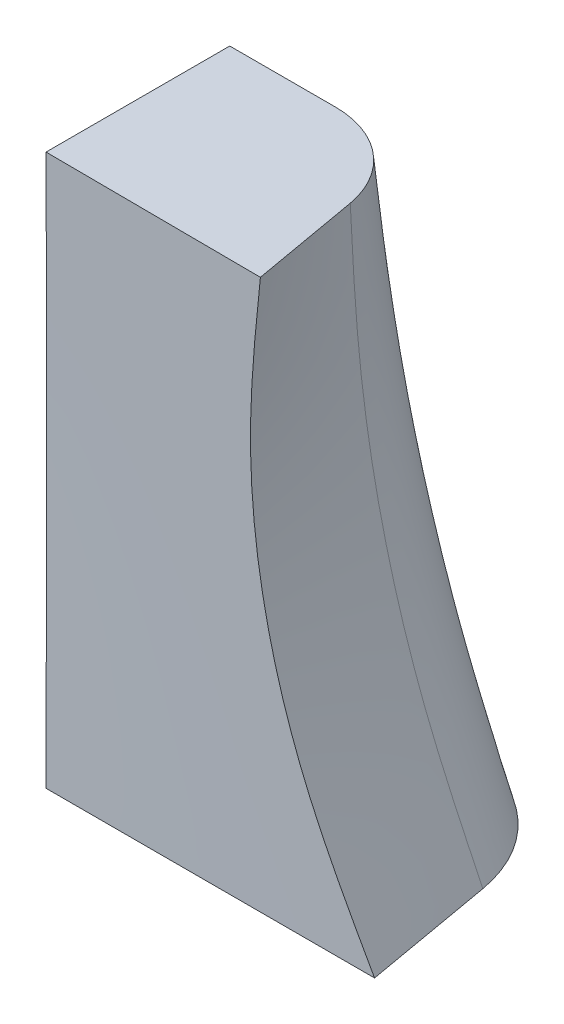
ISO-10303-21;
HEADER;
FILE_DESCRIPTION(('STEP AP214'),'2;1');
FILE_NAME('part.step','',(''),(''),'','','');
FILE_SCHEMA(('AUTOMOTIVE_DESIGN { 1 0 10303 214 1 1 1 1 }'));
ENDSEC;
DATA;
#1=APPLICATION_CONTEXT('core data for automotive mechanical design processes');
#2=APPLICATION_PROTOCOL_DEFINITION('international standard','automotive_design',2000,#1);
#3=PRODUCT_CONTEXT('',#1,'mechanical');
#4=PRODUCT('Part','Part','',(#3));
#5=PRODUCT_RELATED_PRODUCT_CATEGORY('part','',(#4));
#6=PRODUCT_DEFINITION_FORMATION('','',#4);
#7=PRODUCT_DEFINITION_CONTEXT('part definition',#1,'design');
#8=PRODUCT_DEFINITION('design','',#6,#7);
#9=PRODUCT_DEFINITION_SHAPE('','',#8);
#10=(LENGTH_UNIT() NAMED_UNIT(*) SI_UNIT(.MILLI.,.METRE.));
#11=(NAMED_UNIT(*) PLANE_ANGLE_UNIT() SI_UNIT($,.RADIAN.));
#12=(NAMED_UNIT(*) SI_UNIT($,.STERADIAN.) SOLID_ANGLE_UNIT());
#13=UNCERTAINTY_MEASURE_WITH_UNIT(LENGTH_MEASURE(1.E-05),#10,'distance_accuracy_value','');
#14=(GEOMETRIC_REPRESENTATION_CONTEXT(3) GLOBAL_UNCERTAINTY_ASSIGNED_CONTEXT((#13)) GLOBAL_UNIT_ASSIGNED_CONTEXT((#10,
#11,#12)) REPRESENTATION_CONTEXT('',''));
#15=CARTESIAN_POINT('',(0.,0.,0.));
#16=DIRECTION('',(0.,0.,1.));
#17=DIRECTION('',(1.,0.,0.));
#18=AXIS2_PLACEMENT_3D('',#15,#16,#17);
#19=CARTESIAN_POINT('',(0.,0.,0.));
#20=DIRECTION('',(1.,0.,0.));
#21=DIRECTION('',(0.,0.,-1.));
#22=AXIS2_PLACEMENT_3D('',#19,#20,#21);
#23=PLANE('',#22);
#24=DIRECTION('',(0.,0.,1.));
#25=VECTOR('',#24,1.);
#26=CARTESIAN_POINT('',(0.,-76.2,-14.877560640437));
#27=LINE('',#26,#25);
#28=CARTESIAN_POINT('',(0.,-76.2,-33.927560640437));
#29=VERTEX_POINT('',#28);
#30=CARTESIAN_POINT('',(0.,-76.2,0.));
#31=VERTEX_POINT('',#30);
#32=EDGE_CURVE('E112',#29,#31,#27,.T.);
#33=ORIENTED_EDGE('',*,*,#32,.T.);
#34=CARTESIAN_POINT('',(0.,0.,0.));
#35=CARTESIAN_POINT('',(-1.17821968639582E-05,-1.87268849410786,-0.00648347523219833));
#36=CARTESIAN_POINT('',(-0.000104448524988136,-3.74537705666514,-0.0129742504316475));
#37=CARTESIAN_POINT('',(-0.000403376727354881,-7.90213113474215,-0.0268625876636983));
#38=CARTESIAN_POINT('',(-0.000630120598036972,-10.18619702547,-0.0341461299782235));
#39=CARTESIAN_POINT('',(-0.0011067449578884,-15.1641656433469,-0.0483084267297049));
#40=CARTESIAN_POINT('',(-0.00135347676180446,-17.8580693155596,-0.054880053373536));
#41=CARTESIAN_POINT('',(-0.00172382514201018,-23.6480838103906,-0.0652793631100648));
#42=CARTESIAN_POINT('',(-0.00182356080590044,-26.7441956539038,-0.0685508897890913));
#43=CARTESIAN_POINT('',(-0.00186543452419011,-33.3066324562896,-0.0716167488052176));
#44=CARTESIAN_POINT('',(-0.00178730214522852,-36.7729575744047,-0.0709485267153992));
#45=CARTESIAN_POINT('',(-0.00148589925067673,-44.0168844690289,-0.0657968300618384));
#46=CARTESIAN_POINT('',(-0.00125022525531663,-47.7944859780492,-0.0609761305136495));
#47=CARTESIAN_POINT('',(-0.000757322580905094,-55.5722846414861,-0.048073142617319));
#48=CARTESIAN_POINT('',(-0.000499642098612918,-59.5724814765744,-0.0398153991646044));
#49=CARTESIAN_POINT('',(-0.00010535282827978,-67.7817859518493,-0.0211164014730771));
#50=CARTESIAN_POINT('',(2.42300176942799E-05,-71.9908933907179,-0.0105836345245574));
#51=CARTESIAN_POINT('',(0.,-76.2,0.));
#52=B_SPLINE_CURVE_WITH_KNOTS('',3,(#34,#35,#36,#37,#38,#39,#40,#41,#42,#43,#44,#45,#46,#47,#48,
#49,#50,#51),.UNSPECIFIED.,.F.,.F.,(4,2,2,2,2,2,2,2,4),(0.,5.61809930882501,12.4703317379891,
20.5520651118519,29.8404027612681,40.2393760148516,51.5721879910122,63.5728035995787,
76.2001644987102),.UNSPECIFIED.);
#53=CARTESIAN_POINT('',(0.,0.,0.));
#54=VERTEX_POINT('',#53);
#55=EDGE_CURVE('E101',#31,#54,#52,.F.);
#56=ORIENTED_EDGE('',*,*,#55,.T.);
#57=DIRECTION('',(0.,0.,-1.));
#58=VECTOR('',#57,1.);
#59=CARTESIAN_POINT('',(0.,0.,-12.7));
#60=LINE('',#59,#58);
#61=CARTESIAN_POINT('',(0.,0.,-25.4));
#62=VERTEX_POINT('',#61);
#63=EDGE_CURVE('E81',#54,#62,#60,.T.);
#64=ORIENTED_EDGE('',*,*,#63,.T.);
#65=CARTESIAN_POINT('',(0.,0.,-25.4));
#66=CARTESIAN_POINT('',(0.,-1.29533201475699,-25.5433238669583));
#67=CARTESIAN_POINT('',(0.,-2.59066405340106,-25.6866476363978));
#68=CARTESIAN_POINT('',(0.,-5.18134355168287,-25.9731586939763));
#69=CARTESIAN_POINT('',(0.,-6.47669101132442,-26.1163459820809));
#70=CARTESIAN_POINT('',(0.,-9.06741616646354,-26.4024477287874));
#71=CARTESIAN_POINT('',(0.,-10.3627938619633,-26.5453621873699));
#72=CARTESIAN_POINT('',(0.,-12.9535981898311,-26.8307798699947));
#73=CARTESIAN_POINT('',(0.,-14.2490248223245,-26.9732830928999));
#74=CARTESIAN_POINT('',(0.,-16.839937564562,-27.257746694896));
#75=CARTESIAN_POINT('',(0.,-18.1354236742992,-27.3997070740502));
#76=CARTESIAN_POINT('',(0.,-20.7264728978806,-27.6829224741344));
#77=CARTESIAN_POINT('',(0.,-22.0220360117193,-27.8241774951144));
#78=CARTESIAN_POINT('',(0.,-25.2610097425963,-28.1767176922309));
#79=CARTESIAN_POINT('',(0.,-27.2044528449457,-28.3877041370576));
#80=CARTESIAN_POINT('',(0.,-31.0913585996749,-28.8094997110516));
#81=CARTESIAN_POINT('',(0.,-33.0348212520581,-29.0203088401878));
#82=CARTESIAN_POINT('',(0.,-36.9216589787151,-29.4426568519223));
#83=CARTESIAN_POINT('',(0.,-38.8650340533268,-29.6541957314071));
#84=CARTESIAN_POINT('',(0.,-42.7515978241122,-30.0789806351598));
#85=CARTESIAN_POINT('',(0.,-44.6947865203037,-30.2922266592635));
#86=CARTESIAN_POINT('',(0.,-47.8702938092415,-30.6430134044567));
#87=CARTESIAN_POINT('',(0.,-49.1027043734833,-30.7797210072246));
#88=CARTESIAN_POINT('',(0.,-51.5673654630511,-31.054572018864));
#89=CARTESIAN_POINT('',(0.,-52.799615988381,-31.1927154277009));
#90=CARTESIAN_POINT('',(0.,-55.2639194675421,-31.4707578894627));
#91=CARTESIAN_POINT('',(0.,-56.4959724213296,-31.6106569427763));
#92=CARTESIAN_POINT('',(0.,-58.9598255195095,-31.8926623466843));
#93=CARTESIAN_POINT('',(0.,-60.1916256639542,-32.0347686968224));
#94=CARTESIAN_POINT('',(0.,-62.655018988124,-32.3209626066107));
#95=CARTESIAN_POINT('',(0.,-63.8866121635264,-32.4650502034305));
#96=CARTESIAN_POINT('',(0.,-66.3496199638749,-32.754747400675));
#97=CARTESIAN_POINT('',(0.,-67.5810345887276,-32.9003570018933));
#98=CARTESIAN_POINT('',(0.,-70.0437403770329,-33.1926315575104));
#99=CARTESIAN_POINT('',(0.,-71.2750315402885,-33.3392965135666));
#100=CARTESIAN_POINT('',(0.,-73.7375487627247,-33.6331593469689));
#101=CARTESIAN_POINT('',(0.,-74.9687748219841,-33.7803572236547));
#102=CARTESIAN_POINT('',(0.,-76.2,-33.927560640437));
#103=B_SPLINE_CURVE_WITH_KNOTS('',3,(#65,#66,#67,#68,#69,#70,#71,#72,#73,#74,#75,#76,#77,#78,
#79,#80,#81,#82,#83,#84,#85,#86,#87,#88,#89,#90,#91,#92,#93,#94,#95,#96,#97,#98,#99,#100,#101,
#102),.UNSPECIFIED.,.F.,.F.,(4,2,2,2,2,2,2,2,2,2,2,2,2,2,2,2,2,2,4),(0.,3.90971111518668,
7.81942321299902,11.7291355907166,15.6388587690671,19.5485814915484,23.4583039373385,
29.3228905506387,35.1874781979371,41.052040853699,46.9166029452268,50.6365112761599,
54.3564195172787,58.0763285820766,61.7962368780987,65.5162150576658,69.2361951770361,
72.9561811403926,76.6761624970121),.UNSPECIFIED.);
#104=EDGE_CURVE('E14',#62,#29,#103,.T.);
#105=ORIENTED_EDGE('',*,*,#104,.T.);
#106=EDGE_LOOP('',(#33,#56,#64,#105));
#107=FACE_BOUND('',#106,.T.);
#108=ADVANCED_FACE('F58',(#107),#23,.F.);
#109=CARTESIAN_POINT('',(-23.4582958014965,-76.2,-14.877560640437));
#110=DIRECTION('',(0.,-1.,0.));
#111=DIRECTION('',(0.,0.,-1.));
#112=AXIS2_PLACEMENT_3D('',#109,#110,#111);
#113=PLANE('',#112);
#114=ORIENTED_EDGE('',*,*,#32,.F.);
#115=DIRECTION('',(-1.,0.,0.));
#116=VECTOR('',#115,1.);
#117=CARTESIAN_POINT('',(23.4582958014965,-76.2,-33.927560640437));
#118=LINE('',#117,#116);
#119=CARTESIAN_POINT('',(23.4582958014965,-76.2,-33.927560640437));
#120=VERTEX_POINT('',#119);
#121=EDGE_CURVE('E111',#120,#29,#118,.T.);
#122=ORIENTED_EDGE('',*,*,#121,.F.);
#123=CARTESIAN_POINT('',(23.4582958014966,-76.2,-14.877560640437));
#124=DIRECTION('',(0.,1.,0.));
#125=DIRECTION('',(0.,0.,1.));
#126=AXIS2_PLACEMENT_3D('',#123,#124,#125);
#127=CIRCLE('',#126,19.05);
#128=CARTESIAN_POINT('',(42.2188834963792,-76.2,-18.1855584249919));
#129=VERTEX_POINT('',#128);
#130=EDGE_CURVE('E168',#129,#120,#127,.T.);
#131=ORIENTED_EDGE('',*,*,#130,.F.);
#132=DIRECTION('',(-0.173648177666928,0.,-0.984807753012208));
#133=VECTOR('',#132,1.);
#134=CARTESIAN_POINT('',(45.4254881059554,-76.2,0.));
#135=LINE('',#134,#133);
#136=CARTESIAN_POINT('',(45.4254881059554,-76.2,0.));
#137=VERTEX_POINT('',#136);
#138=EDGE_CURVE('E120',#137,#129,#135,.T.);
#139=ORIENTED_EDGE('',*,*,#138,.F.);
#140=DIRECTION('',(1.,0.,0.));
#141=VECTOR('',#140,1.);
#142=CARTESIAN_POINT('',(0.,-76.2,0.));
#143=LINE('',#142,#141);
#144=EDGE_CURVE('E106',#31,#137,#143,.T.);
#145=ORIENTED_EDGE('',*,*,#144,.F.);
#146=EDGE_LOOP('',(#114,#122,#131,#139,#145));
#147=FACE_BOUND('',#146,.T.);
#148=ADVANCED_FACE('F60',(#147),#113,.T.);
#149=CARTESIAN_POINT('',(-15.0010822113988,0.,-12.7));
#150=DIRECTION('',(0.,1.,0.));
#151=DIRECTION('',(0.,0.,1.));
#152=AXIS2_PLACEMENT_3D('',#149,#150,#151);
#153=PLANE('',#152);
#154=ORIENTED_EDGE('',*,*,#63,.F.);
#155=DIRECTION('',(0.999982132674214,0.,0.00597782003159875));
#156=VECTOR('',#155,1.);
#157=CARTESIAN_POINT('',(0.,0.,0.));
#158=LINE('',#157,#156);
#159=CARTESIAN_POINT('',(29.8187001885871,0.,0.178254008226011));
#160=VERTEX_POINT('',#159);
#161=EDGE_CURVE('E67',#54,#160,#158,.T.);
#162=ORIENTED_EDGE('',*,*,#161,.T.);
#163=DIRECTION('',(0.173648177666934,0.,0.984807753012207));
#164=VECTOR('',#163,1.);
#165=CARTESIAN_POINT('',(27.159057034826,0.,-14.9053318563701));
#166=LINE('',#165,#164);
#167=CARTESIAN_POINT('',(27.159057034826,0.,-14.9053318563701));
#168=VERTEX_POINT('',#167);
#169=EDGE_CURVE('E140',#168,#160,#166,.T.);
#170=ORIENTED_EDGE('',*,*,#169,.F.);
#171=CARTESIAN_POINT('',(14.6519985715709,0.,-12.7));
#172=DIRECTION('',(0.,1.,0.));
#173=DIRECTION('',(0.,0.,1.));
#174=AXIS2_PLACEMENT_3D('',#171,#172,#173);
#175=CIRCLE('',#174,12.7);
#176=CARTESIAN_POINT('',(14.6519985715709,0.,-25.4));
#177=VERTEX_POINT('',#176);
#178=EDGE_CURVE('E136',#168,#177,#175,.T.);
#179=ORIENTED_EDGE('',*,*,#178,.T.);
#180=DIRECTION('',(-1.,0.,0.));
#181=VECTOR('',#180,1.);
#182=CARTESIAN_POINT('',(14.6519985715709,0.,-25.4));
#183=LINE('',#182,#181);
#184=EDGE_CURVE('E134',#177,#62,#183,.T.);
#185=ORIENTED_EDGE('',*,*,#184,.T.);
#186=EDGE_LOOP('',(#154,#162,#170,#179,#185));
#187=FACE_BOUND('',#186,.T.);
#188=ADVANCED_FACE('F182',(#187),#153,.T.);
#189=CARTESIAN_POINT('',(29.8187001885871,0.,0.178254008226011));
#190=CARTESIAN_POINT('',(29.0965883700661,-6.63484166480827,0.140421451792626));
#191=CARTESIAN_POINT('',(26.930252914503,-26.5393666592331,0.0269237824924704));
#192=CARTESIAN_POINT('',(32.3360496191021,-52.9331198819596,0.000928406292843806));
#193=CARTESIAN_POINT('',(42.153128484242,-70.3832799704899,0.000232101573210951));
#194=CARTESIAN_POINT('',(45.4254881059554,-76.2,0.));
#195=CARTESIAN_POINT('',(19.8791334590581,0.,0.118836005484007));
#196=CARTESIAN_POINT('',(19.3973049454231,-6.63329244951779,0.0859549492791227));
#197=CARTESIAN_POINT('',(17.951819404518,-26.5331697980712,-0.0126882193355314));
#198=CARTESIAN_POINT('',(21.5565057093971,-52.9266079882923,-0.018877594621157));
#199=CARTESIAN_POINT('',(28.101870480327,-70.3816519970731,-0.00471939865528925));
#200=CARTESIAN_POINT('',(30.2836587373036,-76.2,0.));
#201=CARTESIAN_POINT('',(9.93956672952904,0.,0.0594180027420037));
#202=CARTESIAN_POINT('',(9.69802152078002,-6.63174323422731,0.0314884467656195));
#203=CARTESIAN_POINT('',(8.97338589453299,-26.5269729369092,-0.0523002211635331));
#204=CARTESIAN_POINT('',(10.776961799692,-52.9200960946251,-0.0386835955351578));
#205=CARTESIAN_POINT('',(14.0506124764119,-70.3800240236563,-0.00967089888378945));
#206=CARTESIAN_POINT('',(15.1418293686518,-76.2,0.));
#207=CARTESIAN_POINT('',(0.,0.,0.));
#208=CARTESIAN_POINT('',(-0.00126190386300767,-6.63019401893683,-0.0229780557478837));
#209=CARTESIAN_POINT('',(-0.00504761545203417,-26.5207760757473,-0.0919122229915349));
#210=CARTESIAN_POINT('',(-0.00258211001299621,-52.9135842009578,-0.0584895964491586));
#211=CARTESIAN_POINT('',(-0.000645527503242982,-70.3783960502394,-0.0146223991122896));
#212=CARTESIAN_POINT('',(0.,-76.2,0.));
#213=B_SPLINE_SURFACE_WITH_KNOTS('',3,3,((#189,#190,#191,#192,#193,#194),(#195,#196,#197,#198,
#199,#200),(#201,#202,#203,#204,#205,#206),(#207,#208,#209,#210,#211,#212)),.UNSPECIFIED.,.F.,
.F.,.F.,(4,4),(4,1,1,4),(0.,1.),(0.,0.25,0.75,1.),.UNSPECIFIED.);
#214=CARTESIAN_POINT('',(29.8187001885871,0.,0.178254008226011));
#215=CARTESIAN_POINT('',(29.0965883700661,-6.63484166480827,0.140421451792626));
#216=CARTESIAN_POINT('',(26.930252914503,-26.5393666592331,0.0269237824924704));
#217=CARTESIAN_POINT('',(32.3360496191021,-52.9331198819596,0.000928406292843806));
#218=CARTESIAN_POINT('',(42.153128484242,-70.3832799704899,0.000232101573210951));
#219=CARTESIAN_POINT('',(45.4254881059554,-76.2,0.));
#220=B_SPLINE_CURVE_WITH_KNOTS('',3,(#214,#215,#216,#217,#218,#219),.UNSPECIFIED.,.F.,.F.,(4,1,
1,4),(0.,0.25,0.75,1.),.UNSPECIFIED.);
#221=EDGE_CURVE('E137',#137,#160,#220,.F.);
#222=ORIENTED_EDGE('',*,*,#55,.F.);
#223=ORIENTED_EDGE('',*,*,#144,.T.);
#224=ORIENTED_EDGE('',*,*,#221,.T.);
#225=ORIENTED_EDGE('',*,*,#161,.F.);
#226=EDGE_LOOP('',(#222,#223,#224,#225));
#227=FACE_BOUND('',#226,.T.);
#228=ADVANCED_FACE('F104',(#227),#213,.T.);
#229=CARTESIAN_POINT('',(27.159057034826,0.,-14.9053318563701));
#230=CARTESIAN_POINT('',(27.1999313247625,-6.6329826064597,-15.2016621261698));
#231=CARTESIAN_POINT('',(27.3225541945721,-26.5319304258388,-16.0906529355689));
#232=CARTESIAN_POINT('',(32.4656029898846,-52.9253056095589,-17.1506391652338));
#233=CARTESIAN_POINT('',(39.7805633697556,-70.3813264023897,-17.9268286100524));
#234=CARTESIAN_POINT('',(42.2188834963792,-76.2,-18.1855584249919));
#235=CARTESIAN_POINT('',(27.186761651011,0.,-14.7482111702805));
#236=CARTESIAN_POINT('',(27.2278938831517,-6.6329826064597,-15.0430785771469));
#237=CARTESIAN_POINT('',(27.3517168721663,-26.5319304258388,-15.9252631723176));
#238=CARTESIAN_POINT('',(32.4966282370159,-52.9253056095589,-16.9746862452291));
#239=CARTESIAN_POINT('',(39.8132732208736,-70.3813264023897,-17.7413218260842));
#240=CARTESIAN_POINT('',(42.252285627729,-76.2,-17.9961255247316));
#241=CARTESIAN_POINT('',(27.2802647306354,0.,-14.2179288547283));
#242=CARTESIAN_POINT('',(27.2863675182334,-6.63306732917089,-14.5024786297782));
#243=CARTESIAN_POINT('',(27.3046758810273,-26.5322693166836,-15.3561279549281));
#244=CARTESIAN_POINT('',(32.4596988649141,-52.9256617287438,-16.3689922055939));
#245=CARTESIAN_POINT('',(39.8886880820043,-70.381415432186,-17.1098401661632));
#246=CARTESIAN_POINT('',(42.3650178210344,-76.2,-17.3567894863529));
#247=CARTESIAN_POINT('',(28.1668124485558,0.,-9.19006689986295));
#248=CARTESIAN_POINT('',(27.9185865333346,-6.63368701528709,-9.38845077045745));
#249=CARTESIAN_POINT('',(27.1739087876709,-26.5347480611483,-9.98360238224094));
#250=CARTESIAN_POINT('',(32.4165144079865,-52.9282664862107,-10.651803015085));
#251=CARTESIAN_POINT('',(40.6795431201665,-70.3820666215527,-11.134153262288));
#252=CARTESIAN_POINT('',(43.4338860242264,-76.2,-11.2949366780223));
#253=CARTESIAN_POINT('',(29.0256555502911,0.,-4.31932563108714));
#254=CARTESIAN_POINT('',(28.5310487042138,-6.63428733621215,-4.43423628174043));
#255=CARTESIAN_POINT('',(27.047228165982,-26.5371493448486,-4.7789682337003));
#256=CARTESIAN_POINT('',(32.374679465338,-52.9307898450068,-5.11327598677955));
#257=CARTESIAN_POINT('',(41.4456839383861,-70.3826974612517,-5.34520657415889));
#258=CARTESIAN_POINT('',(44.4693520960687,-76.2,-5.42251676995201));
#259=CARTESIAN_POINT('',(29.8187001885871,0.,0.178254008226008));
#260=CARTESIAN_POINT('',(29.0965883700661,-6.63484166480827,0.140421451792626));
#261=CARTESIAN_POINT('',(26.930252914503,-26.5393666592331,0.0269237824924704));
#262=CARTESIAN_POINT('',(32.3360496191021,-52.9331198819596,0.000928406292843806));
#263=CARTESIAN_POINT('',(42.153128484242,-70.3832799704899,0.000232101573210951));
#264=CARTESIAN_POINT('',(45.4254881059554,-76.2,0.));
#265=B_SPLINE_SURFACE_WITH_KNOTS('',3,3,((#229,#230,#231,#232,#233,#234),(#235,#236,#237,#238,
#239,#240),(#241,#242,#243,#244,#245,#246),(#247,#248,#249,#250,#251,#252),(#253,#254,#255,#256,
#257,#258),(#259,#260,#261,#262,#263,#264)),.UNSPECIFIED.,.F.,.F.,.F.,(4,1,1,4),(4,1,1,4),(0.,
0.03125,0.10546875,1.),(0.,0.25,0.75,1.),.UNSPECIFIED.);
#266=CARTESIAN_POINT('',(27.159057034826,0.,-14.9053318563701));
#267=CARTESIAN_POINT('',(27.1999313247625,-6.6329826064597,-15.2016621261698));
#268=CARTESIAN_POINT('',(27.3225541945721,-26.5319304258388,-16.0906529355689));
#269=CARTESIAN_POINT('',(32.4656029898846,-52.9253056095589,-17.1506391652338));
#270=CARTESIAN_POINT('',(39.7805633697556,-70.3813264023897,-17.9268286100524));
#271=CARTESIAN_POINT('',(42.2188834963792,-76.2,-18.1855584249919));
#272=B_SPLINE_CURVE_WITH_KNOTS('',3,(#266,#267,#268,#269,#270,#271),.UNSPECIFIED.,.F.,.F.,(4,1,
1,4),(0.,0.25,0.75,1.),.UNSPECIFIED.);
#273=EDGE_CURVE('E147',#129,#168,#272,.F.);
#274=ORIENTED_EDGE('',*,*,#169,.T.);
#275=ORIENTED_EDGE('',*,*,#221,.F.);
#276=ORIENTED_EDGE('',*,*,#138,.T.);
#277=ORIENTED_EDGE('',*,*,#273,.T.);
#278=EDGE_LOOP('',(#274,#275,#276,#277));
#279=FACE_BOUND('',#278,.T.);
#280=ADVANCED_FACE('F191',(#279),#265,.T.);
#281=CARTESIAN_POINT('',(14.6519985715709,0.,-25.4));
#282=CARTESIAN_POINT('',(14.980311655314,-6.63112354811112,-26.1336081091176));
#283=CARTESIAN_POINT('',(15.9652509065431,-26.5244941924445,-28.3344324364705));
#284=CARTESIAN_POINT('',(18.9433625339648,-52.9174913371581,-31.1435300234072));
#285=CARTESIAN_POINT('',(22.3295624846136,-70.3793728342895,-33.2315529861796));
#286=CARTESIAN_POINT('',(23.4582958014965,-76.2,-33.927560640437));
#287=CARTESIAN_POINT('',(14.8229024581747,0.,-25.4));
#288=CARTESIAN_POINT('',(15.1511928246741,-6.63112354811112,-26.1336081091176));
#289=CARTESIAN_POINT('',(16.1360639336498,-26.5244941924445,-28.3344324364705));
#290=CARTESIAN_POINT('',(19.1433701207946,-52.9174913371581,-31.1435300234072));
#291=CARTESIAN_POINT('',(22.5718312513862,-70.3793728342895,-33.2315529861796));
#292=CARTESIAN_POINT('',(23.7146516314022,-76.2,-33.927560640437));
#293=CARTESIAN_POINT('',(15.4075859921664,0.,-25.3882251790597));
#294=CARTESIAN_POINT('',(15.7356194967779,-6.63119657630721,-26.1213426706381));
#295=CARTESIAN_POINT('',(16.7197200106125,-26.5247863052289,-28.3206951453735));
#296=CARTESIAN_POINT('',(19.826922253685,-52.9177983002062,-31.1278302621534));
#297=CARTESIAN_POINT('',(23.4004882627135,-70.3794495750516,-33.2143813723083));
#298=CARTESIAN_POINT('',(24.5916769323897,-76.2,-33.9098984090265));
#299=CARTESIAN_POINT('',(21.0012962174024,0.,-24.8883699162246));
#300=CARTESIAN_POINT('',(21.3205484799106,-6.631752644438,-25.6006601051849));
#301=CARTESIAN_POINT('',(22.2783052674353,-26.527010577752,-27.7375306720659));
#302=CARTESIAN_POINT('',(26.3418494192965,-52.9201356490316,-30.4613565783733));
#303=CARTESIAN_POINT('',(31.322144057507,-70.3800339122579,-32.4854257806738));
#304=CARTESIAN_POINT('',(32.9822422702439,-76.2,-33.1601155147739));
#305=CARTESIAN_POINT('',(25.552655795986,0.,-21.0693257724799));
#306=CARTESIAN_POINT('',(25.8002115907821,-6.6323535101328,-21.6224891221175));
#307=CARTESIAN_POINT('',(26.5428789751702,-26.5294140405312,-23.2819791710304));
#308=CARTESIAN_POINT('',(31.3909779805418,-52.9226612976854,-25.369297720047));
#309=CARTESIAN_POINT('',(37.704705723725,-70.3806653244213,-26.9159864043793));
#310=CARTESIAN_POINT('',(39.8092816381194,-76.2,-27.4315492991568));
#311=CARTESIAN_POINT('',(27.0162547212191,0.,-15.6473955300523));
#312=CARTESIAN_POINT('',(27.0829413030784,-6.6329095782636,-15.9746451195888));
#313=CARTESIAN_POINT('',(27.2830010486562,-26.5316383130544,-16.9563938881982));
#314=CARTESIAN_POINT('',(32.3990900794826,-52.9249986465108,-18.1400573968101));
#315=CARTESIAN_POINT('',(39.6032825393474,-70.3812496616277,-19.009004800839));
#316=CARTESIAN_POINT('',(42.004680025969,-76.2,-19.2986539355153));
#317=CARTESIAN_POINT('',(27.129379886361,0.,-15.0736393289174));
#318=CARTESIAN_POINT('',(27.1692087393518,-6.6329826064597,-15.3758985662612));
#319=CARTESIAN_POINT('',(27.2884406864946,-26.5319304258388,-16.2841202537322));
#320=CARTESIAN_POINT('',(32.4265816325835,-52.9253056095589,-17.3719402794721));
#321=CARTESIAN_POINT('',(39.7374777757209,-70.3813264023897,-18.1711791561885));
#322=CARTESIAN_POINT('',(42.1743677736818,-76.2,-18.4380196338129));
#323=CARTESIAN_POINT('',(27.159057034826,0.,-14.9053318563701));
#324=CARTESIAN_POINT('',(27.1999313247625,-6.6329826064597,-15.2016621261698));
#325=CARTESIAN_POINT('',(27.3225541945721,-26.5319304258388,-16.0906529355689));
#326=CARTESIAN_POINT('',(32.4656029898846,-52.9253056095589,-17.1506391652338));
#327=CARTESIAN_POINT('',(39.7805633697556,-70.3813264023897,-17.9268286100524));
#328=CARTESIAN_POINT('',(42.2188834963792,-76.2,-18.1855584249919));
#329=(BOUNDED_SURFACE() B_SPLINE_SURFACE(3,3,((#281,#282,#283,#284,#285,#286),(#287,#288,#289,
#290,#291,#292),(#293,#294,#295,#296,#297,#298),(#299,#300,#301,#302,#303,#304),(#305,#306,#307,
#308,#309,#310),(#311,#312,#313,#314,#315,#316),(#317,#318,#319,#320,#321,#322),(#323,#324,#325,
#326,#327,#328)),.UNSPECIFIED.,.F.,.F.,.F.) B_SPLINE_SURFACE_WITH_KNOTS((4,1,1,1,1,4),(4,1,1,4),
(0.,0.03125,0.10546875,0.89453125,0.96875,1.),(0.,0.25,0.75,1.),
.UNSPECIFIED.) GEOMETRIC_REPRESENTATION_ITEM() RATIONAL_B_SPLINE_SURFACE(((1.,1.,1.,1.,1.,1.),
(0.995125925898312,0.995125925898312,0.995125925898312,0.995125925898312,0.995125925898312,
0.995125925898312),(0.979189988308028,0.979189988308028,0.979189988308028,0.979189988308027,
0.979189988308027,0.979189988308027),(0.858744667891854,0.858744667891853,0.858744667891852,
0.858744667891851,0.85874466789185,0.85874466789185),(0.858744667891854,0.858744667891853,
0.858744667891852,0.858744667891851,0.85874466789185,0.85874466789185),(0.979189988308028,
0.979189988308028,0.979189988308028,0.979189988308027,0.979189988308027,0.979189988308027),
(0.995125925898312,0.995125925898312,0.995125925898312,0.995125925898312,0.995125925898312,
0.995125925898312),(1.,1.,1.,1.,1.,1.))) REPRESENTATION_ITEM('') SURFACE());
#330=CARTESIAN_POINT('',(14.6519985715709,0.,-25.4));
#331=CARTESIAN_POINT('',(14.980311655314,-6.63112354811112,-26.1336081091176));
#332=CARTESIAN_POINT('',(15.9652509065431,-26.5244941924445,-28.3344324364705));
#333=CARTESIAN_POINT('',(18.9433625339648,-52.9174913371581,-31.1435300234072));
#334=CARTESIAN_POINT('',(22.3295624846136,-70.3793728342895,-33.2315529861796));
#335=CARTESIAN_POINT('',(23.4582958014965,-76.2,-33.927560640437));
#336=B_SPLINE_CURVE_WITH_KNOTS('',3,(#330,#331,#332,#333,#334,#335),.UNSPECIFIED.,.F.,.F.,(4,1,
1,4),(0.,0.25,0.75,1.),.UNSPECIFIED.);
#337=EDGE_CURVE('E121',#120,#177,#336,.F.);
#338=ORIENTED_EDGE('',*,*,#178,.F.);
#339=ORIENTED_EDGE('',*,*,#273,.F.);
#340=ORIENTED_EDGE('',*,*,#130,.T.);
#341=ORIENTED_EDGE('',*,*,#337,.T.);
#342=EDGE_LOOP('',(#338,#339,#340,#341));
#343=FACE_BOUND('',#342,.T.);
#344=ADVANCED_FACE('F216',(#343),#329,.T.);
#345=CARTESIAN_POINT('',(-15.0010822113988,0.,-25.4));
#346=CARTESIAN_POINT('',(-15.3028287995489,-6.62926448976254,-26.1336081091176));
#347=CARTESIAN_POINT('',(-16.208068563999,-26.5170579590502,-28.3344324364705));
#348=CARTESIAN_POINT('',(-19.0648879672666,-52.9096770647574,-31.1435300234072));
#349=CARTESIAN_POINT('',(-22.3599438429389,-70.3774192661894,-33.2315529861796));
#350=CARTESIAN_POINT('',(-23.4582958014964,-76.2,-33.927560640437));
#351=CARTESIAN_POINT('',(-14.6921959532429,0.,-25.4));
#352=CARTESIAN_POINT('',(-14.9873794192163,-6.62926448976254,-26.1336081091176));
#353=CARTESIAN_POINT('',(-15.8729298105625,-26.5170579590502,-28.3344324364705));
#354=CARTESIAN_POINT('',(-18.6689686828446,-52.9096770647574,-31.1435300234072));
#355=CARTESIAN_POINT('',(-21.8944281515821,-70.3774192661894,-33.2315529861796));
#356=CARTESIAN_POINT('',(-22.9695813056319,-76.2,-33.927560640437));
#357=CARTESIAN_POINT('',(-13.6497048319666,0.,-25.4));
#358=CARTESIAN_POINT('',(-13.9227377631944,-6.62934921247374,-26.1336081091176));
#359=CARTESIAN_POINT('',(-14.741836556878,-26.5173968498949,-28.3344324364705));
#360=CARTESIAN_POINT('',(-17.3327411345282,-52.9100331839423,-31.1435300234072));
#361=CARTESIAN_POINT('',(-20.3233126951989,-70.3775082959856,-33.2315529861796));
#362=CARTESIAN_POINT('',(-21.3201698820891,-76.2,-33.927560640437));
#363=CARTESIAN_POINT('',(-4.80783569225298,0.,-25.4));
#364=CARTESIAN_POINT('',(-4.89299926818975,-6.62990354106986,-26.1336081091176));
#365=CARTESIAN_POINT('',(-5.14848999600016,-26.5196141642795,-28.3344324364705));
#366=CARTESIAN_POINT('',(-5.99955185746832,-52.9123632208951,-31.1435300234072));
#367=CARTESIAN_POINT('',(-6.99792604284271,-70.3780908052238,-33.2315529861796));
#368=CARTESIAN_POINT('',(-7.33071743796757,-76.2,-33.927560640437));
#369=CARTESIAN_POINT('',(4.45875205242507,0.,-25.4));
#370=CARTESIAN_POINT('',(4.57048212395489,-6.63048449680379,-26.1336081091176));
#371=CARTESIAN_POINT('',(4.90567233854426,-26.5219379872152,-28.3344324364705));
#372=CARTESIAN_POINT('',(5.87802642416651,-52.9148051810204,-31.1435300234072));
#373=CARTESIAN_POINT('',(6.96754468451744,-70.3787012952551,-33.2315529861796));
#374=CARTESIAN_POINT('',(7.33071743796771,-76.2,-33.927560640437));
#375=CARTESIAN_POINT('',(13.3006211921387,0.,-25.4));
#376=CARTESIAN_POINT('',(13.6002206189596,-6.63103882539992,-26.1336081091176));
#377=CARTESIAN_POINT('',(14.4990188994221,-26.5241553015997,-28.3344324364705));
#378=CARTESIAN_POINT('',(17.2112157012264,-52.9171352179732,-31.1435300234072));
#379=CARTESIAN_POINT('',(20.2929313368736,-70.3792838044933,-33.2315529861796));
#380=CARTESIAN_POINT('',(21.3201698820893,-76.2,-33.927560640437));
#381=CARTESIAN_POINT('',(14.343112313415,0.,-25.4));
#382=CARTESIAN_POINT('',(14.6648622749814,-6.63112354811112,-26.1336081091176));
#383=CARTESIAN_POINT('',(15.6301121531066,-26.5244941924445,-28.3344324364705));
#384=CARTESIAN_POINT('',(18.5474432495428,-52.9174913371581,-31.1435300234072));
#385=CARTESIAN_POINT('',(21.8640467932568,-70.3793728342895,-33.2315529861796));
#386=CARTESIAN_POINT('',(22.969581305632,-76.2,-33.927560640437));
#387=CARTESIAN_POINT('',(14.6519985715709,0.,-25.4));
#388=CARTESIAN_POINT('',(14.980311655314,-6.63112354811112,-26.1336081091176));
#389=CARTESIAN_POINT('',(15.9652509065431,-26.5244941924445,-28.3344324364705));
#390=CARTESIAN_POINT('',(18.9433625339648,-52.9174913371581,-31.1435300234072));
#391=CARTESIAN_POINT('',(22.3295624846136,-70.3793728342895,-33.2315529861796));
#392=CARTESIAN_POINT('',(23.4582958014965,-76.2,-33.927560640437));
#393=B_SPLINE_SURFACE_WITH_KNOTS('',3,3,((#345,#346,#347,#348,#349,#350),(#351,#352,#353,#354,
#355,#356),(#357,#358,#359,#360,#361,#362),(#363,#364,#365,#366,#367,#368),(#369,#370,#371,#372,
#373,#374),(#375,#376,#377,#378,#379,#380),(#381,#382,#383,#384,#385,#386),(#387,#388,#389,#390,
#391,#392)),.UNSPECIFIED.,.F.,.F.,.F.,(4,1,1,1,1,4),(4,1,1,4),(0.,0.03125,0.10546875,0.89453125,
0.96875,1.),(0.,0.25,0.75,1.),.UNSPECIFIED.);
#394=ORIENTED_EDGE('',*,*,#104,.F.);
#395=ORIENTED_EDGE('',*,*,#184,.F.);
#396=ORIENTED_EDGE('',*,*,#337,.F.);
#397=ORIENTED_EDGE('',*,*,#121,.T.);
#398=EDGE_LOOP('',(#394,#395,#396,#397));
#399=FACE_BOUND('',#398,.T.);
#400=ADVANCED_FACE('F174',(#399),#393,.T.);
#401=CLOSED_SHELL('',(#108,#148,#188,#228,#280,#344,#400));
#402=MANIFOLD_SOLID_BREP('B2',#401);
#403=ADVANCED_BREP_SHAPE_REPRESENTATION('',(#18,#402),#14);
#404=SHAPE_DEFINITION_REPRESENTATION(#9,#403);
ENDSEC;
END-ISO-10303-21;
